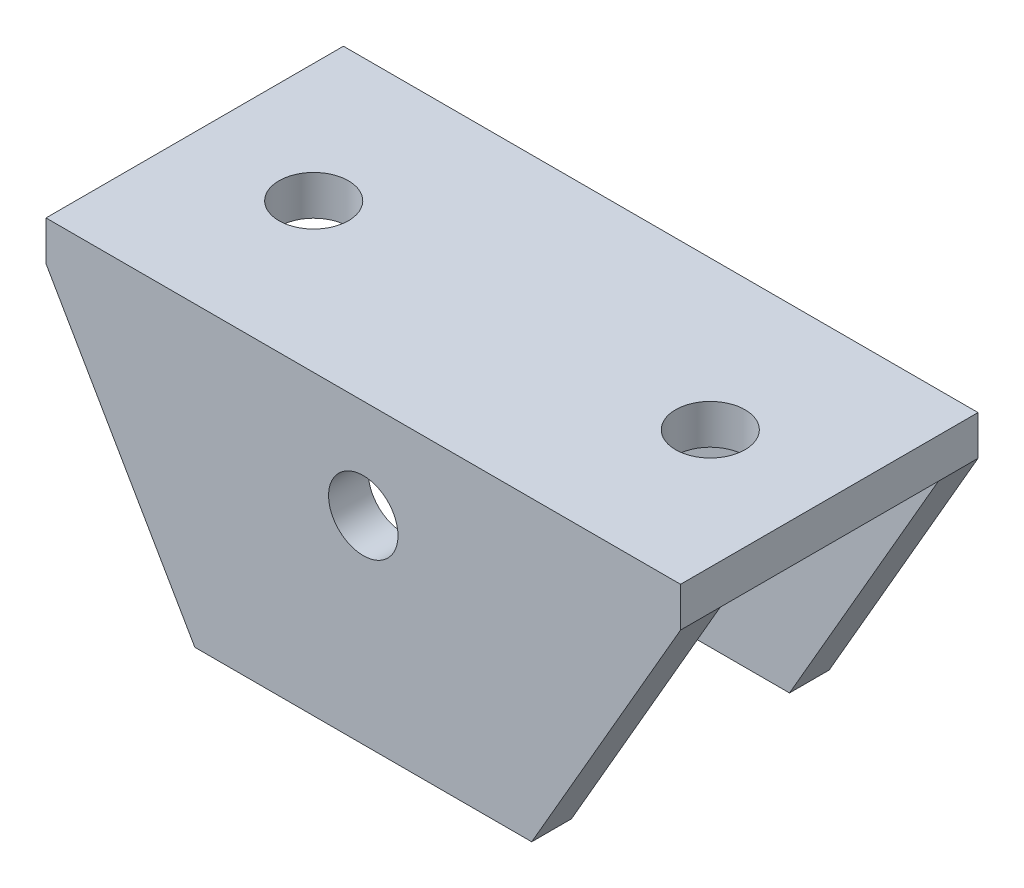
ISO-10303-21;
HEADER;
FILE_DESCRIPTION(('STEP AP214'),'2;1');
FILE_NAME('part.step','',(''),(''),'','','');
FILE_SCHEMA(('AUTOMOTIVE_DESIGN { 1 0 10303 214 1 1 1 1 }'));
ENDSEC;
DATA;
#1=APPLICATION_CONTEXT('core data for automotive mechanical design processes');
#2=APPLICATION_PROTOCOL_DEFINITION('international standard','automotive_design',2000,#1);
#3=PRODUCT_CONTEXT('',#1,'mechanical');
#4=PRODUCT('Part','Part','',(#3));
#5=PRODUCT_RELATED_PRODUCT_CATEGORY('part','',(#4));
#6=PRODUCT_DEFINITION_FORMATION('','',#4);
#7=PRODUCT_DEFINITION_CONTEXT('part definition',#1,'design');
#8=PRODUCT_DEFINITION('design','',#6,#7);
#9=PRODUCT_DEFINITION_SHAPE('','',#8);
#10=(LENGTH_UNIT() NAMED_UNIT(*) SI_UNIT(.MILLI.,.METRE.));
#11=(NAMED_UNIT(*) PLANE_ANGLE_UNIT() SI_UNIT($,.RADIAN.));
#12=(NAMED_UNIT(*) SI_UNIT($,.STERADIAN.) SOLID_ANGLE_UNIT());
#13=UNCERTAINTY_MEASURE_WITH_UNIT(LENGTH_MEASURE(1.E-05),#10,'distance_accuracy_value','');
#14=(GEOMETRIC_REPRESENTATION_CONTEXT(3) GLOBAL_UNCERTAINTY_ASSIGNED_CONTEXT((#13)) GLOBAL_UNIT_ASSIGNED_CONTEXT((#10,
#11,#12)) REPRESENTATION_CONTEXT('',''));
#15=CARTESIAN_POINT('',(0.,0.,0.));
#16=DIRECTION('',(0.,0.,1.));
#17=DIRECTION('',(1.,0.,0.));
#18=AXIS2_PLACEMENT_3D('',#15,#16,#17);
#19=CARTESIAN_POINT('',(32.,0.,-2.));
#20=DIRECTION('',(0.,1.,0.));
#21=DIRECTION('',(0.,0.,1.));
#22=AXIS2_PLACEMENT_3D('',#19,#20,#21);
#23=PLANE('',#22);
#24=DIRECTION('',(-1.,0.,0.));
#25=VECTOR('',#24,1.);
#26=CARTESIAN_POINT('',(32.,0.,-2.));
#27=LINE('',#26,#25);
#28=CARTESIAN_POINT('',(24.4944465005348,0.,-2.));
#29=VERTEX_POINT('',#28);
#30=CARTESIAN_POINT('',(7.50555349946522,0.,-2.));
#31=VERTEX_POINT('',#30);
#32=EDGE_CURVE('E165',#29,#31,#27,.T.);
#33=ORIENTED_EDGE('',*,*,#32,.F.);
#34=DIRECTION('',(0.,0.,1.));
#35=VECTOR('',#34,1.);
#36=CARTESIAN_POINT('',(24.4944465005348,0.,-32.));
#37=LINE('',#36,#35);
#38=CARTESIAN_POINT('',(24.4944465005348,0.,0.));
#39=VERTEX_POINT('',#38);
#40=EDGE_CURVE('E125',#29,#39,#37,.T.);
#41=ORIENTED_EDGE('',*,*,#40,.T.);
#42=DIRECTION('',(-1.,0.,0.));
#43=VECTOR('',#42,1.);
#44=CARTESIAN_POINT('',(32.,0.,0.));
#45=LINE('',#44,#43);
#46=CARTESIAN_POINT('',(7.50555349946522,0.,0.));
#47=VERTEX_POINT('',#46);
#48=EDGE_CURVE('E124',#39,#47,#45,.T.);
#49=ORIENTED_EDGE('',*,*,#48,.T.);
#50=DIRECTION('',(0.,0.,1.));
#51=VECTOR('',#50,1.);
#52=CARTESIAN_POINT('',(7.50555349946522,0.,-32.));
#53=LINE('',#52,#51);
#54=EDGE_CURVE('E191',#31,#47,#53,.T.);
#55=ORIENTED_EDGE('',*,*,#54,.F.);
#56=EDGE_LOOP('',(#33,#41,#49,#55));
#57=FACE_BOUND('',#56,.T.);
#58=ADVANCED_FACE('F33',(#57),#23,.F.);
#59=CARTESIAN_POINT('',(32.,13.,-2.));
#60=DIRECTION('',(0.,0.,1.));
#61=DIRECTION('',(0.,-1.,0.));
#62=AXIS2_PLACEMENT_3D('',#59,#60,#61);
#63=PLANE('',#62);
#64=CARTESIAN_POINT('',(16.,10.,-2.));
#65=DIRECTION('',(0.,0.,1.));
#66=DIRECTION('',(0.,-1.,0.));
#67=AXIS2_PLACEMENT_3D('',#64,#65,#66);
#68=CIRCLE('',#67,1.75);
#69=CARTESIAN_POINT('',(16.,8.25,-2.));
#70=VERTEX_POINT('',#69);
#71=EDGE_CURVE('E211',#70,#70,#68,.T.);
#72=ORIENTED_EDGE('',*,*,#71,.T.);
#73=EDGE_LOOP('',(#72));
#74=FACE_BOUND('',#73,.T.);
#75=DIRECTION('',(-1.,0.,0.));
#76=VECTOR('',#75,1.);
#77=CARTESIAN_POINT('',(32.,13.,-2.));
#78=LINE('',#77,#76);
#79=CARTESIAN_POINT('',(32.,13.,-2.));
#80=VERTEX_POINT('',#79);
#81=CARTESIAN_POINT('',(0.,13.,-2.));
#82=VERTEX_POINT('',#81);
#83=EDGE_CURVE('E162',#80,#82,#78,.T.);
#84=ORIENTED_EDGE('',*,*,#83,.F.);
#85=DIRECTION('',(-0.500000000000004,-0.866025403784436,0.));
#86=VECTOR('',#85,1.);
#87=CARTESIAN_POINT('',(32.,13.,-2.));
#88=LINE('',#87,#86);
#89=EDGE_CURVE('E113',#80,#29,#88,.T.);
#90=ORIENTED_EDGE('',*,*,#89,.T.);
#91=ORIENTED_EDGE('',*,*,#32,.T.);
#92=DIRECTION('',(-0.500000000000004,0.866025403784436,0.));
#93=VECTOR('',#92,1.);
#94=CARTESIAN_POINT('',(8.00000000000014,-0.856406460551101,-2.));
#95=LINE('',#94,#93);
#96=EDGE_CURVE('E143',#31,#82,#95,.T.);
#97=ORIENTED_EDGE('',*,*,#96,.T.);
#98=EDGE_LOOP('',(#84,#90,#91,#97));
#99=FACE_BOUND('',#98,.T.);
#100=ADVANCED_FACE('F240',(#74,#99),#63,.F.);
#101=CARTESIAN_POINT('',(32.,13.,-13.));
#102=DIRECTION('',(0.,1.,0.));
#103=DIRECTION('',(0.,0.,1.));
#104=AXIS2_PLACEMENT_3D('',#101,#102,#103);
#105=PLANE('',#104);
#106=CARTESIAN_POINT('',(26.,13.,-7.5));
#107=DIRECTION('',(0.,1.,0.));
#108=DIRECTION('',(0.,0.,1.));
#109=AXIS2_PLACEMENT_3D('',#106,#107,#108);
#110=CIRCLE('',#109,1.75);
#111=CARTESIAN_POINT('',(26.,13.,-5.75));
#112=VERTEX_POINT('',#111);
#113=EDGE_CURVE('E205',#112,#112,#110,.T.);
#114=ORIENTED_EDGE('',*,*,#113,.T.);
#115=EDGE_LOOP('',(#114));
#116=FACE_BOUND('',#115,.T.);
#117=CARTESIAN_POINT('',(6.,13.,-7.5));
#118=DIRECTION('',(0.,1.,0.));
#119=DIRECTION('',(0.,0.,1.));
#120=AXIS2_PLACEMENT_3D('',#117,#118,#119);
#121=CIRCLE('',#120,1.75);
#122=CARTESIAN_POINT('',(6.,13.,-5.75));
#123=VERTEX_POINT('',#122);
#124=EDGE_CURVE('E126',#123,#123,#121,.T.);
#125=ORIENTED_EDGE('',*,*,#124,.T.);
#126=EDGE_LOOP('',(#125));
#127=FACE_BOUND('',#126,.T.);
#128=DIRECTION('',(0.,0.,-1.));
#129=VECTOR('',#128,1.);
#130=CARTESIAN_POINT('',(0.,13.,-13.));
#131=LINE('',#130,#129);
#132=CARTESIAN_POINT('',(0.,13.,-13.));
#133=VERTEX_POINT('',#132);
#134=EDGE_CURVE('E139',#82,#133,#131,.T.);
#135=ORIENTED_EDGE('',*,*,#134,.T.);
#136=DIRECTION('',(-1.,0.,0.));
#137=VECTOR('',#136,1.);
#138=CARTESIAN_POINT('',(32.,13.,-13.));
#139=LINE('',#138,#137);
#140=CARTESIAN_POINT('',(32.,13.,-13.));
#141=VERTEX_POINT('',#140);
#142=EDGE_CURVE('E159',#141,#133,#139,.T.);
#143=ORIENTED_EDGE('',*,*,#142,.F.);
#144=DIRECTION('',(0.,0.,-1.));
#145=VECTOR('',#144,1.);
#146=CARTESIAN_POINT('',(32.,13.,-13.));
#147=LINE('',#146,#145);
#148=EDGE_CURVE('E149',#80,#141,#147,.T.);
#149=ORIENTED_EDGE('',*,*,#148,.F.);
#150=ORIENTED_EDGE('',*,*,#83,.T.);
#151=EDGE_LOOP('',(#135,#143,#149,#150));
#152=FACE_BOUND('',#151,.T.);
#153=ADVANCED_FACE('F245',(#116,#127,#152),#105,.F.);
#154=CARTESIAN_POINT('',(32.,0.,-13.));
#155=DIRECTION('',(0.,0.,-1.));
#156=DIRECTION('',(-1.,0.,0.));
#157=AXIS2_PLACEMENT_3D('',#154,#155,#156);
#158=PLANE('',#157);
#159=CARTESIAN_POINT('',(16.,10.,-13.));
#160=DIRECTION('',(0.,0.,-1.));
#161=DIRECTION('',(-1.,0.,0.));
#162=AXIS2_PLACEMENT_3D('',#159,#160,#161);
#163=CIRCLE('',#162,1.75);
#164=CARTESIAN_POINT('',(14.25,10.,-13.));
#165=VERTEX_POINT('',#164);
#166=EDGE_CURVE('E214',#165,#165,#163,.T.);
#167=ORIENTED_EDGE('',*,*,#166,.T.);
#168=EDGE_LOOP('',(#167));
#169=FACE_BOUND('',#168,.T.);
#170=DIRECTION('',(-1.,0.,0.));
#171=VECTOR('',#170,1.);
#172=CARTESIAN_POINT('',(32.,0.,-13.));
#173=LINE('',#172,#171);
#174=CARTESIAN_POINT('',(24.4944465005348,0.,-13.));
#175=VERTEX_POINT('',#174);
#176=CARTESIAN_POINT('',(7.50555349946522,0.,-13.));
#177=VERTEX_POINT('',#176);
#178=EDGE_CURVE('E157',#175,#177,#173,.T.);
#179=ORIENTED_EDGE('',*,*,#178,.F.);
#180=DIRECTION('',(0.500000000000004,0.866025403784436,0.));
#181=VECTOR('',#180,1.);
#182=CARTESIAN_POINT('',(26.3708348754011,3.25000000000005,-13.));
#183=LINE('',#182,#181);
#184=EDGE_CURVE('E195',#175,#141,#183,.T.);
#185=ORIENTED_EDGE('',*,*,#184,.T.);
#186=ORIENTED_EDGE('',*,*,#142,.T.);
#187=DIRECTION('',(0.500000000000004,-0.866025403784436,0.));
#188=VECTOR('',#187,1.);
#189=CARTESIAN_POINT('',(13.629165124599,-10.606406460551,-13.));
#190=LINE('',#189,#188);
#191=EDGE_CURVE('E185',#133,#177,#190,.T.);
#192=ORIENTED_EDGE('',*,*,#191,.T.);
#193=EDGE_LOOP('',(#179,#185,#186,#192));
#194=FACE_BOUND('',#193,.T.);
#195=ADVANCED_FACE('F259',(#169,#194),#158,.F.);
#196=CARTESIAN_POINT('',(32.,0.,-15.));
#197=DIRECTION('',(0.,1.,0.));
#198=DIRECTION('',(0.,0.,1.));
#199=AXIS2_PLACEMENT_3D('',#196,#197,#198);
#200=PLANE('',#199);
#201=DIRECTION('',(-1.,0.,0.));
#202=VECTOR('',#201,1.);
#203=CARTESIAN_POINT('',(32.,0.,-15.));
#204=LINE('',#203,#202);
#205=CARTESIAN_POINT('',(24.4944465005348,0.,-15.));
#206=VERTEX_POINT('',#205);
#207=CARTESIAN_POINT('',(7.50555349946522,0.,-15.));
#208=VERTEX_POINT('',#207);
#209=EDGE_CURVE('E155',#206,#208,#204,.T.);
#210=ORIENTED_EDGE('',*,*,#209,.F.);
#211=EDGE_CURVE('E198',#206,#175,#37,.T.);
#212=ORIENTED_EDGE('',*,*,#211,.T.);
#213=ORIENTED_EDGE('',*,*,#178,.T.);
#214=EDGE_CURVE('E190',#208,#177,#53,.T.);
#215=ORIENTED_EDGE('',*,*,#214,.F.);
#216=EDGE_LOOP('',(#210,#212,#213,#215));
#217=FACE_BOUND('',#216,.T.);
#218=ADVANCED_FACE('F263',(#217),#200,.F.);
#219=CARTESIAN_POINT('',(32.,15.,-15.));
#220=DIRECTION('',(0.,0.,1.));
#221=DIRECTION('',(0.,-1.,0.));
#222=AXIS2_PLACEMENT_3D('',#219,#220,#221);
#223=PLANE('',#222);
#224=CARTESIAN_POINT('',(16.,10.,-15.));
#225=DIRECTION('',(0.,0.,1.));
#226=DIRECTION('',(0.,-1.,0.));
#227=AXIS2_PLACEMENT_3D('',#224,#225,#226);
#228=CIRCLE('',#227,1.75);
#229=CARTESIAN_POINT('',(16.,8.25,-15.));
#230=VERTEX_POINT('',#229);
#231=EDGE_CURVE('E217',#230,#230,#228,.T.);
#232=ORIENTED_EDGE('',*,*,#231,.T.);
#233=EDGE_LOOP('',(#232));
#234=FACE_BOUND('',#233,.T.);
#235=DIRECTION('',(0.,1.,0.));
#236=VECTOR('',#235,1.);
#237=CARTESIAN_POINT('',(32.,15.,-15.));
#238=LINE('',#237,#236);
#239=CARTESIAN_POINT('',(32.,13.,-15.));
#240=VERTEX_POINT('',#239);
#241=CARTESIAN_POINT('',(32.,15.,-15.));
#242=VERTEX_POINT('',#241);
#243=EDGE_CURVE('E135',#240,#242,#238,.T.);
#244=ORIENTED_EDGE('',*,*,#243,.F.);
#245=DIRECTION('',(-0.500000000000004,-0.866025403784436,0.));
#246=VECTOR('',#245,1.);
#247=CARTESIAN_POINT('',(32.8660254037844,14.5,-15.));
#248=LINE('',#247,#246);
#249=EDGE_CURVE('E47',#240,#206,#248,.T.);
#250=ORIENTED_EDGE('',*,*,#249,.T.);
#251=ORIENTED_EDGE('',*,*,#209,.T.);
#252=DIRECTION('',(-0.500000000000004,0.866025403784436,0.));
#253=VECTOR('',#252,1.);
#254=CARTESIAN_POINT('',(7.13397459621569,0.64359353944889,-15.));
#255=LINE('',#254,#253);
#256=CARTESIAN_POINT('',(0.,13.,-15.));
#257=VERTEX_POINT('',#256);
#258=EDGE_CURVE('E188',#208,#257,#255,.T.);
#259=ORIENTED_EDGE('',*,*,#258,.T.);
#260=DIRECTION('',(0.,1.,0.));
#261=VECTOR('',#260,1.);
#262=CARTESIAN_POINT('',(0.,15.,-15.));
#263=LINE('',#262,#261);
#264=CARTESIAN_POINT('',(0.,15.,-15.));
#265=VERTEX_POINT('',#264);
#266=EDGE_CURVE('E142',#257,#265,#263,.T.);
#267=ORIENTED_EDGE('',*,*,#266,.T.);
#268=DIRECTION('',(-1.,0.,0.));
#269=VECTOR('',#268,1.);
#270=CARTESIAN_POINT('',(32.,15.,-15.));
#271=LINE('',#270,#269);
#272=EDGE_CURVE('E152',#242,#265,#271,.T.);
#273=ORIENTED_EDGE('',*,*,#272,.F.);
#274=EDGE_LOOP('',(#244,#250,#251,#259,#267,#273));
#275=FACE_BOUND('',#274,.T.);
#276=ADVANCED_FACE('F180',(#234,#275),#223,.F.);
#277=CARTESIAN_POINT('',(32.,15.,0.));
#278=DIRECTION('',(0.,-1.,0.));
#279=DIRECTION('',(0.,0.,-1.));
#280=AXIS2_PLACEMENT_3D('',#277,#278,#279);
#281=PLANE('',#280);
#282=CARTESIAN_POINT('',(26.,15.,-7.5));
#283=DIRECTION('',(0.,1.,0.));
#284=DIRECTION('',(0.,0.,1.));
#285=AXIS2_PLACEMENT_3D('',#282,#283,#284);
#286=CIRCLE('',#285,1.75);
#287=CARTESIAN_POINT('',(26.,15.,-5.75));
#288=VERTEX_POINT('',#287);
#289=EDGE_CURVE('E208',#288,#288,#286,.T.);
#290=ORIENTED_EDGE('',*,*,#289,.F.);
#291=EDGE_LOOP('',(#290));
#292=FACE_BOUND('',#291,.T.);
#293=CARTESIAN_POINT('',(6.,15.,-7.5));
#294=DIRECTION('',(0.,1.,0.));
#295=DIRECTION('',(0.,0.,1.));
#296=AXIS2_PLACEMENT_3D('',#293,#294,#295);
#297=CIRCLE('',#296,1.75);
#298=CARTESIAN_POINT('',(6.,15.,-5.75));
#299=VERTEX_POINT('',#298);
#300=EDGE_CURVE('E202',#299,#299,#297,.T.);
#301=ORIENTED_EDGE('',*,*,#300,.F.);
#302=EDGE_LOOP('',(#301));
#303=FACE_BOUND('',#302,.T.);
#304=DIRECTION('',(0.,0.,1.));
#305=VECTOR('',#304,1.);
#306=CARTESIAN_POINT('',(0.,15.,0.));
#307=LINE('',#306,#305);
#308=CARTESIAN_POINT('',(0.,15.,0.));
#309=VERTEX_POINT('',#308);
#310=EDGE_CURVE('E145',#265,#309,#307,.T.);
#311=ORIENTED_EDGE('',*,*,#310,.T.);
#312=DIRECTION('',(-1.,0.,0.));
#313=VECTOR('',#312,1.);
#314=CARTESIAN_POINT('',(32.,15.,0.));
#315=LINE('',#314,#313);
#316=CARTESIAN_POINT('',(32.,15.,0.));
#317=VERTEX_POINT('',#316);
#318=EDGE_CURVE('E133',#317,#309,#315,.T.);
#319=ORIENTED_EDGE('',*,*,#318,.F.);
#320=DIRECTION('',(0.,0.,1.));
#321=VECTOR('',#320,1.);
#322=CARTESIAN_POINT('',(32.,15.,0.));
#323=LINE('',#322,#321);
#324=EDGE_CURVE('E130',#242,#317,#323,.T.);
#325=ORIENTED_EDGE('',*,*,#324,.F.);
#326=ORIENTED_EDGE('',*,*,#272,.T.);
#327=EDGE_LOOP('',(#311,#319,#325,#326));
#328=FACE_BOUND('',#327,.T.);
#329=ADVANCED_FACE('F228',(#292,#303,#328),#281,.F.);
#330=CARTESIAN_POINT('',(32.,0.,0.));
#331=DIRECTION('',(0.,0.,-1.));
#332=DIRECTION('',(-1.,0.,0.));
#333=AXIS2_PLACEMENT_3D('',#330,#331,#332);
#334=PLANE('',#333);
#335=CARTESIAN_POINT('',(16.,10.,0.));
#336=DIRECTION('',(0.,0.,1.));
#337=DIRECTION('',(1.,0.,0.));
#338=AXIS2_PLACEMENT_3D('',#335,#336,#337);
#339=CIRCLE('',#338,1.75);
#340=CARTESIAN_POINT('',(17.75,10.,0.));
#341=VERTEX_POINT('',#340);
#342=EDGE_CURVE('E220',#341,#341,#339,.T.);
#343=ORIENTED_EDGE('',*,*,#342,.F.);
#344=EDGE_LOOP('',(#343));
#345=FACE_BOUND('',#344,.T.);
#346=ORIENTED_EDGE('',*,*,#48,.F.);
#347=DIRECTION('',(-0.500000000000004,-0.866025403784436,0.));
#348=VECTOR('',#347,1.);
#349=CARTESIAN_POINT('',(24.4944465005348,0.,0.));
#350=LINE('',#349,#348);
#351=CARTESIAN_POINT('',(32.,13.,0.));
#352=VERTEX_POINT('',#351);
#353=EDGE_CURVE('E110',#352,#39,#350,.T.);
#354=ORIENTED_EDGE('',*,*,#353,.F.);
#355=DIRECTION('',(0.,-1.,0.));
#356=VECTOR('',#355,1.);
#357=CARTESIAN_POINT('',(32.,0.,0.));
#358=LINE('',#357,#356);
#359=EDGE_CURVE('E123',#317,#352,#358,.T.);
#360=ORIENTED_EDGE('',*,*,#359,.F.);
#361=ORIENTED_EDGE('',*,*,#318,.T.);
#362=DIRECTION('',(0.,-1.,0.));
#363=VECTOR('',#362,1.);
#364=CARTESIAN_POINT('',(0.,0.,0.));
#365=LINE('',#364,#363);
#366=CARTESIAN_POINT('',(0.,13.,0.));
#367=VERTEX_POINT('',#366);
#368=EDGE_CURVE('E147',#309,#367,#365,.T.);
#369=ORIENTED_EDGE('',*,*,#368,.T.);
#370=DIRECTION('',(-0.500000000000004,0.866025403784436,0.));
#371=VECTOR('',#370,1.);
#372=CARTESIAN_POINT('',(0.,13.,0.));
#373=LINE('',#372,#371);
#374=EDGE_CURVE('E55',#47,#367,#373,.T.);
#375=ORIENTED_EDGE('',*,*,#374,.F.);
#376=EDGE_LOOP('',(#346,#354,#360,#361,#369,#375));
#377=FACE_BOUND('',#376,.T.);
#378=ADVANCED_FACE('F121',(#345,#377),#334,.F.);
#379=CARTESIAN_POINT('',(32.,0.,0.));
#380=DIRECTION('',(-1.,0.,0.));
#381=DIRECTION('',(0.,0.,1.));
#382=AXIS2_PLACEMENT_3D('',#379,#380,#381);
#383=PLANE('',#382);
#384=ORIENTED_EDGE('',*,*,#359,.T.);
#385=DIRECTION('',(0.,0.,-1.));
#386=VECTOR('',#385,1.);
#387=CARTESIAN_POINT('',(32.,13.,0.));
#388=LINE('',#387,#386);
#389=EDGE_CURVE('E11',#352,#80,#388,.T.);
#390=ORIENTED_EDGE('',*,*,#389,.T.);
#391=ORIENTED_EDGE('',*,*,#148,.T.);
#392=EDGE_CURVE('E36',#141,#240,#388,.T.);
#393=ORIENTED_EDGE('',*,*,#392,.T.);
#394=ORIENTED_EDGE('',*,*,#243,.T.);
#395=ORIENTED_EDGE('',*,*,#324,.T.);
#396=EDGE_LOOP('',(#384,#390,#391,#393,#394,#395));
#397=FACE_BOUND('',#396,.T.);
#398=ADVANCED_FACE('F128',(#397),#383,.F.);
#399=CARTESIAN_POINT('',(0.,0.,0.));
#400=DIRECTION('',(-1.,0.,0.));
#401=DIRECTION('',(0.,0.,1.));
#402=AXIS2_PLACEMENT_3D('',#399,#400,#401);
#403=PLANE('',#402);
#404=DIRECTION('',(0.,0.,-1.));
#405=VECTOR('',#404,1.);
#406=CARTESIAN_POINT('',(0.,13.,0.));
#407=LINE('',#406,#405);
#408=EDGE_CURVE('E167',#367,#82,#407,.T.);
#409=ORIENTED_EDGE('',*,*,#408,.F.);
#410=ORIENTED_EDGE('',*,*,#368,.F.);
#411=ORIENTED_EDGE('',*,*,#310,.F.);
#412=ORIENTED_EDGE('',*,*,#266,.F.);
#413=EDGE_CURVE('E166',#133,#257,#407,.T.);
#414=ORIENTED_EDGE('',*,*,#413,.F.);
#415=ORIENTED_EDGE('',*,*,#134,.F.);
#416=EDGE_LOOP('',(#409,#410,#411,#412,#414,#415));
#417=FACE_BOUND('',#416,.T.);
#418=ADVANCED_FACE('F234',(#417),#403,.T.);
#419=CARTESIAN_POINT('',(0.,13.,-32.));
#420=DIRECTION('',(0.866025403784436,0.500000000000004,0.));
#421=DIRECTION('',(-0.500000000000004,0.866025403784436,0.));
#422=AXIS2_PLACEMENT_3D('',#419,#420,#421);
#423=PLANE('',#422);
#424=ORIENTED_EDGE('',*,*,#413,.T.);
#425=ORIENTED_EDGE('',*,*,#258,.F.);
#426=ORIENTED_EDGE('',*,*,#214,.T.);
#427=ORIENTED_EDGE('',*,*,#191,.F.);
#428=EDGE_LOOP('',(#424,#425,#426,#427));
#429=FACE_BOUND('',#428,.T.);
#430=ADVANCED_FACE('F266',(#429),#423,.F.);
#431=ORIENTED_EDGE('',*,*,#54,.T.);
#432=ORIENTED_EDGE('',*,*,#374,.T.);
#433=ORIENTED_EDGE('',*,*,#408,.T.);
#434=ORIENTED_EDGE('',*,*,#96,.F.);
#435=EDGE_LOOP('',(#431,#432,#433,#434));
#436=FACE_BOUND('',#435,.T.);
#437=ADVANCED_FACE('F250',(#436),#423,.F.);
#438=CARTESIAN_POINT('',(24.4944465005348,0.,-32.));
#439=DIRECTION('',(-0.866025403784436,0.500000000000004,0.));
#440=DIRECTION('',(-0.500000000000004,-0.866025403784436,0.));
#441=AXIS2_PLACEMENT_3D('',#438,#439,#440);
#442=PLANE('',#441);
#443=ORIENTED_EDGE('',*,*,#211,.F.);
#444=ORIENTED_EDGE('',*,*,#249,.F.);
#445=ORIENTED_EDGE('',*,*,#392,.F.);
#446=ORIENTED_EDGE('',*,*,#184,.F.);
#447=EDGE_LOOP('',(#443,#444,#445,#446));
#448=FACE_BOUND('',#447,.T.);
#449=ADVANCED_FACE('F261',(#448),#442,.F.);
#450=ORIENTED_EDGE('',*,*,#389,.F.);
#451=ORIENTED_EDGE('',*,*,#353,.T.);
#452=ORIENTED_EDGE('',*,*,#40,.F.);
#453=ORIENTED_EDGE('',*,*,#89,.F.);
#454=EDGE_LOOP('',(#450,#451,#452,#453));
#455=FACE_BOUND('',#454,.T.);
#456=ADVANCED_FACE('F109',(#455),#442,.F.);
#457=CARTESIAN_POINT('',(6.,-17.,-7.5));
#458=DIRECTION('',(0.,1.,0.));
#459=DIRECTION('',(0.,0.,1.));
#460=AXIS2_PLACEMENT_3D('',#457,#458,#459);
#461=CYLINDRICAL_SURFACE('',#460,1.75);
#462=ORIENTED_EDGE('',*,*,#300,.T.);
#463=EDGE_LOOP('',(#462));
#464=FACE_BOUND('',#463,.T.);
#465=ORIENTED_EDGE('',*,*,#124,.F.);
#466=EDGE_LOOP('',(#465));
#467=FACE_BOUND('',#466,.T.);
#468=ADVANCED_FACE('F276',(#464,#467),#461,.F.);
#469=CARTESIAN_POINT('',(26.,-17.,-7.5));
#470=DIRECTION('',(0.,1.,0.));
#471=DIRECTION('',(0.,0.,1.));
#472=AXIS2_PLACEMENT_3D('',#469,#470,#471);
#473=CYLINDRICAL_SURFACE('',#472,1.75);
#474=ORIENTED_EDGE('',*,*,#289,.T.);
#475=EDGE_LOOP('',(#474));
#476=FACE_BOUND('',#475,.T.);
#477=ORIENTED_EDGE('',*,*,#113,.F.);
#478=EDGE_LOOP('',(#477));
#479=FACE_BOUND('',#478,.T.);
#480=ADVANCED_FACE('F279',(#476,#479),#473,.F.);
#481=CARTESIAN_POINT('',(16.,10.,-32.));
#482=DIRECTION('',(0.,0.,1.));
#483=DIRECTION('',(1.,0.,0.));
#484=AXIS2_PLACEMENT_3D('',#481,#482,#483);
#485=CYLINDRICAL_SURFACE('',#484,1.75);
#486=ORIENTED_EDGE('',*,*,#342,.T.);
#487=EDGE_LOOP('',(#486));
#488=FACE_BOUND('',#487,.T.);
#489=ORIENTED_EDGE('',*,*,#71,.F.);
#490=EDGE_LOOP('',(#489));
#491=FACE_BOUND('',#490,.T.);
#492=ADVANCED_FACE('F224',(#488,#491),#485,.F.);
#493=ORIENTED_EDGE('',*,*,#231,.F.);
#494=EDGE_LOOP('',(#493));
#495=FACE_BOUND('',#494,.T.);
#496=ORIENTED_EDGE('',*,*,#166,.F.);
#497=EDGE_LOOP('',(#496));
#498=FACE_BOUND('',#497,.T.);
#499=ADVANCED_FACE('F285',(#495,#498),#485,.F.);
#500=CLOSED_SHELL('',(#58,#100,#153,#195,#218,#276,#329,#378,#398,#418,#430,#437,#449,#456,#468,
#480,#492,#499));
#501=MANIFOLD_SOLID_BREP('B2',#500);
#502=ADVANCED_BREP_SHAPE_REPRESENTATION('',(#18,#501),#14);
#503=SHAPE_DEFINITION_REPRESENTATION(#9,#502);
ENDSEC;
END-ISO-10303-21;
